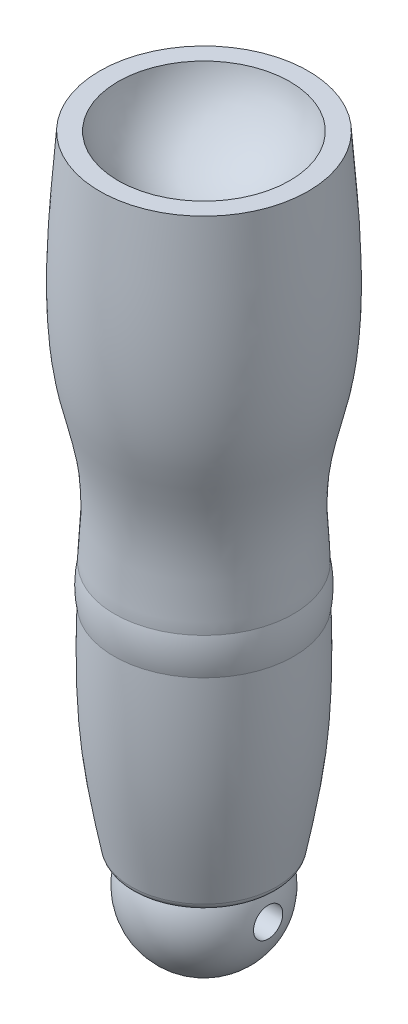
from build123d import *

# Parameters (mm, degrees)
CONG_1_R = 5


with BuildPart() as part:
    # Esquisse1 → R_volution1 (revolve)
    with BuildSketch(Plane.XY):
        with BuildLine():
            Line((0, 0), (-39, 0))
            add(Edge.make_bspline(
                [(-39, 0), (-42.493664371, 17.817284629), (-49.567675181, 53.893922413), (-49.812838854, 98.541407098), (-49.138494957, 117.803713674)],
                knots=[0, 0, 0, 0, 0.16380018, 0.331664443, 0.331664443, 0.331664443, 0.331664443], degree=3))
            ThreePointArc((-49.138494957, 117.803713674), (-49.994792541, 127.766983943), (-48.851298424, 137.701389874))
            add(Edge.make_bspline(
                [(-48.851298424, 137.701389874), (-48.942188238, 142.651345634), (-44.685100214, 184.285365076), (-65.635430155, 233.162681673), (-60.371209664, 299.510695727), (-57, 342)],
                knots=[0.416310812, 0.416310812, 0.416310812, 0.416310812, 0.459604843, 0.653930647, 1, 1, 1, 1], degree=3))
            Line((-57, 342), (0, 342))
            Line((0, 342), (0, 0))
        make_face()
    revolve(axis=Axis((0, 0, 0), (0, 1, 0)))

    # Esquisse2 → Enl_vement de mati_re-R_volution1 (revolve, cut)
    with BuildSketch(Plane.XY):
        with BuildLine():
            Line((0, 304), (0, 400))
            ThreePointArc((0, 400), (48, 352), (0, 304))
        make_face()
    revolve(axis=Axis((0, 256.51308451, 0), (0, 1, 0)), mode=Mode.SUBTRACT)

    # Esquisse3 → R_volution3 (revolve)
    with BuildSketch(Plane.XY, mode=Mode.PRIVATE) as r_volution3_sk:
        with BuildLine():
            Line((35.09985755, -7), (-35.09985755, -7))
            ThreePointArc((-35.09985755, -7), (0, 21), (35.09985755, -7))
        make_face()
    revolve(r_volution3_sk.sketch.rotate(Axis((-63.162539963, -15, 0), (1, 0, 0)), 90), axis=Axis((-63.162539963, -15, 0), (1, 0, 0)))

    # Cong_1
    cong_1_edges = [part.edges().sort_by_distance(p)[0] for p in [
        (39, 0, 0),
    ]]
    fillet(cong_1_edges, radius=CONG_1_R)


solid = part.part
